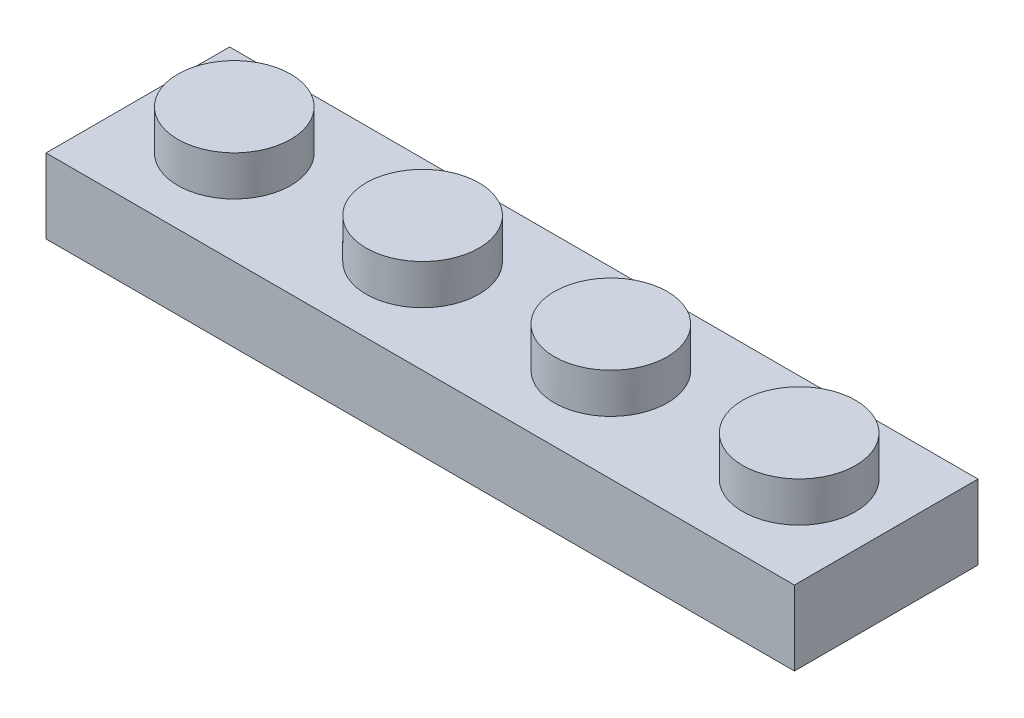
from build123d import *

# Parameters (mm, degrees)
SKETCH1_W       = 31.8
SKETCH1_H       = 7.8
EXTRUDE1_DEPTH  = 3.166
SKETCH2_R       = 2.4
EXTRUDE2_DEPTH  = 1.7
SKETCH3_W       = 4.8
SKETCH3_H       = 4.8
EXTRUDE3_DEPTH  = 1.75
LPATTERN1_COUNT = 4
LPATTERN1_PITCH = 8
LPATTERN2_COUNT = 4
LPATTERN2_PITCH = 8


with BuildPart() as part:
    # Sketch1 → Extrude1 (new body)
    with BuildSketch(Plane(origin=(0, 0, 0), x_dir=(1, 0, 0), z_dir=(0, 1, 0))):
        with Locations((15.9, 3.9)):
            Rectangle(SKETCH1_W, SKETCH1_H)
    extrude(amount=EXTRUDE1_DEPTH)

    # Sketch2 → Extrude2 (add)
    with BuildSketch(Plane(origin=(0, 3.166, 0), x_dir=(1, 0, 0), z_dir=(0, 1, 0))):
        with Locations(Location((4, 4, 0), (0, 0, 90))):
            Circle(SKETCH2_R)
    extrude2 = extrude(amount=EXTRUDE2_DEPTH)

    # Sketch3 → Extrude3 (cut)
    with BuildSketch(Plane.XZ):
        with Locations((27.95, -3.95)):
            Rectangle(SKETCH3_W, SKETCH3_H)
    extrude3 = extrude(amount=-EXTRUDE3_DEPTH, mode=Mode.SUBTRACT)

    # LPattern1: Extrude2 ×4
    with Locations(*[(i * LPATTERN1_PITCH, 0, 0) for i in range(1, LPATTERN1_COUNT)]):
        add(extrude2)

    # LPattern2: Extrude3 ×4
    with Locations(*[(-i * LPATTERN2_PITCH, 0, 0) for i in range(1, LPATTERN2_COUNT)]):
        add(extrude3, mode=Mode.SUBTRACT)


solid = part.part
